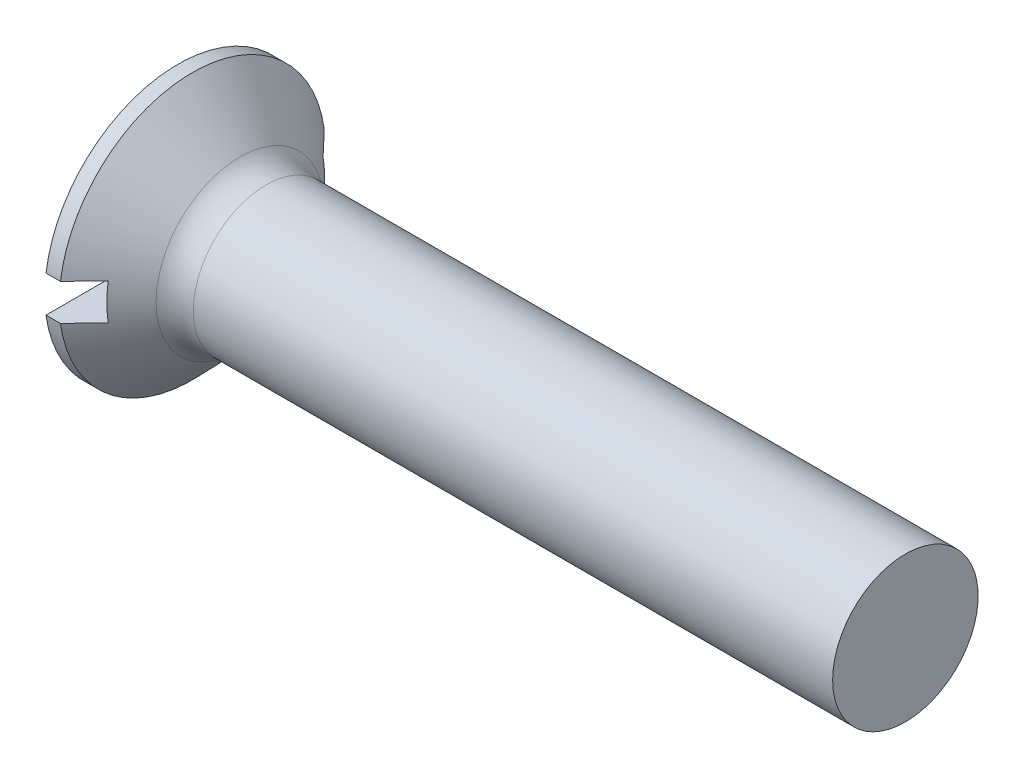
ISO-10303-21;
HEADER;
FILE_DESCRIPTION(('STEP AP214'),'2;1');
FILE_NAME('part.step','',(''),(''),'','','');
FILE_SCHEMA(('AUTOMOTIVE_DESIGN { 1 0 10303 214 1 1 1 1 }'));
ENDSEC;
DATA;
#1=APPLICATION_CONTEXT('core data for automotive mechanical design processes');
#2=APPLICATION_PROTOCOL_DEFINITION('international standard','automotive_design',2000,#1);
#3=PRODUCT_CONTEXT('',#1,'mechanical');
#4=PRODUCT('Part','Part','',(#3));
#5=PRODUCT_RELATED_PRODUCT_CATEGORY('part','',(#4));
#6=PRODUCT_DEFINITION_FORMATION('','',#4);
#7=PRODUCT_DEFINITION_CONTEXT('part definition',#1,'design');
#8=PRODUCT_DEFINITION('design','',#6,#7);
#9=PRODUCT_DEFINITION_SHAPE('','',#8);
#10=(LENGTH_UNIT() NAMED_UNIT(*) SI_UNIT(.MILLI.,.METRE.));
#11=(NAMED_UNIT(*) PLANE_ANGLE_UNIT() SI_UNIT($,.RADIAN.));
#12=(NAMED_UNIT(*) SI_UNIT($,.STERADIAN.) SOLID_ANGLE_UNIT());
#13=UNCERTAINTY_MEASURE_WITH_UNIT(LENGTH_MEASURE(1.E-05),#10,'distance_accuracy_value','');
#14=(GEOMETRIC_REPRESENTATION_CONTEXT(3) GLOBAL_UNCERTAINTY_ASSIGNED_CONTEXT((#13)) GLOBAL_UNIT_ASSIGNED_CONTEXT((#10,
#11,#12)) REPRESENTATION_CONTEXT('',''));
#15=CARTESIAN_POINT('',(0.,0.,0.));
#16=DIRECTION('',(0.,0.,1.));
#17=DIRECTION('',(1.,0.,0.));
#18=AXIS2_PLACEMENT_3D('',#15,#16,#17);
#19=CARTESIAN_POINT('',(0.,0.,0.));
#20=DIRECTION('',(-1.,0.,0.));
#21=DIRECTION('',(0.,0.,1.));
#22=AXIS2_PLACEMENT_3D('',#19,#20,#21);
#23=PLANE('',#22);
#24=DIRECTION('',(0.,0.,-1.));
#25=VECTOR('',#24,1.);
#26=CARTESIAN_POINT('',(0.,1.25,9.15));
#27=LINE('',#26,#25);
#28=CARTESIAN_POINT('',(0.,1.25,9.06421535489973));
#29=VERTEX_POINT('',#28);
#30=CARTESIAN_POINT('',(0.,1.25,-9.06421535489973));
#31=VERTEX_POINT('',#30);
#32=EDGE_CURVE('E171',#29,#31,#27,.T.);
#33=ORIENTED_EDGE('',*,*,#32,.F.);
#34=CARTESIAN_POINT('',(0.,0.,0.));
#35=DIRECTION('',(-1.,0.,0.));
#36=DIRECTION('',(0.,0.,1.));
#37=AXIS2_PLACEMENT_3D('',#34,#35,#36);
#38=CIRCLE('',#37,9.15);
#39=EDGE_CURVE('E115',#29,#31,#38,.T.);
#40=ORIENTED_EDGE('',*,*,#39,.T.);
#41=EDGE_LOOP('',(#33,#40));
#42=FACE_BOUND('',#41,.T.);
#43=ADVANCED_FACE('F34',(#42),#23,.T.);
#44=CARTESIAN_POINT('',(-6.34999999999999,0.,0.));
#45=DIRECTION('',(-1.,0.,0.));
#46=DIRECTION('',(0.,0.,1.));
#47=AXIS2_PLACEMENT_3D('',#44,#45,#46);
#48=CYLINDRICAL_SURFACE('',#47,9.15);
#49=DIRECTION('',(-1.,0.,0.));
#50=VECTOR('',#49,1.);
#51=CARTESIAN_POINT('',(-6.34999999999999,1.25,-9.06421535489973));
#52=LINE('',#51,#50);
#53=CARTESIAN_POINT('',(0.992391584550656,1.25,-9.06421535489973));
#54=VERTEX_POINT('',#53);
#55=EDGE_CURVE('E62',#31,#54,#52,.F.);
#56=ORIENTED_EDGE('',*,*,#55,.F.);
#57=ORIENTED_EDGE('',*,*,#39,.F.);
#58=DIRECTION('',(-1.,0.,0.));
#59=VECTOR('',#58,1.);
#60=CARTESIAN_POINT('',(-6.34999999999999,1.25,9.06421535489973));
#61=LINE('',#60,#59);
#62=CARTESIAN_POINT('',(0.992391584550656,1.25,9.06421535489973));
#63=VERTEX_POINT('',#62);
#64=EDGE_CURVE('E177',#63,#29,#61,.T.);
#65=ORIENTED_EDGE('',*,*,#64,.F.);
#66=CARTESIAN_POINT('',(0.992391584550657,0.,0.));
#67=DIRECTION('',(-1.,0.,0.));
#68=DIRECTION('',(0.,0.,1.));
#69=AXIS2_PLACEMENT_3D('',#66,#67,#68);
#70=CIRCLE('',#69,9.15);
#71=EDGE_CURVE('E109',#63,#54,#70,.T.);
#72=ORIENTED_EDGE('',*,*,#71,.T.);
#73=EDGE_LOOP('',(#56,#57,#65,#72));
#74=FACE_BOUND('',#73,.T.);
#75=ADVANCED_FACE('F155',(#74),#48,.T.);
#76=DIRECTION('',(0.,0.,1.));
#77=VECTOR('',#76,1.);
#78=CARTESIAN_POINT('',(0.,-1.25,-9.15));
#79=LINE('',#78,#77);
#80=CARTESIAN_POINT('',(0.,-1.25,-9.06421535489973));
#81=VERTEX_POINT('',#80);
#82=CARTESIAN_POINT('',(0.,-1.25,9.06421535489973));
#83=VERTEX_POINT('',#82);
#84=EDGE_CURVE('E103',#81,#83,#79,.T.);
#85=ORIENTED_EDGE('',*,*,#84,.F.);
#86=EDGE_CURVE('E111',#81,#83,#38,.T.);
#87=ORIENTED_EDGE('',*,*,#86,.T.);
#88=EDGE_LOOP('',(#85,#87));
#89=FACE_BOUND('',#88,.T.);
#90=ADVANCED_FACE('F157',(#89),#23,.T.);
#91=DIRECTION('',(-1.,0.,0.));
#92=VECTOR('',#91,1.);
#93=CARTESIAN_POINT('',(-6.34999999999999,-1.25,9.06421535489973));
#94=LINE('',#93,#92);
#95=CARTESIAN_POINT('',(0.992391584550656,-1.25,9.06421535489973));
#96=VERTEX_POINT('',#95);
#97=EDGE_CURVE('E176',#83,#96,#94,.F.);
#98=ORIENTED_EDGE('',*,*,#97,.F.);
#99=ORIENTED_EDGE('',*,*,#86,.F.);
#100=DIRECTION('',(-1.,0.,0.));
#101=VECTOR('',#100,1.);
#102=CARTESIAN_POINT('',(-6.34999999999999,-1.25,-9.06421535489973));
#103=LINE('',#102,#101);
#104=CARTESIAN_POINT('',(0.992391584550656,-1.25,-9.06421535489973));
#105=VERTEX_POINT('',#104);
#106=EDGE_CURVE('E174',#105,#81,#103,.T.);
#107=ORIENTED_EDGE('',*,*,#106,.F.);
#108=EDGE_CURVE('E112',#105,#96,#70,.T.);
#109=ORIENTED_EDGE('',*,*,#108,.T.);
#110=EDGE_LOOP('',(#98,#99,#107,#109));
#111=FACE_BOUND('',#110,.T.);
#112=ADVANCED_FACE('F152',(#111),#48,.T.);
#113=CARTESIAN_POINT('',(0.992391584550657,0.,0.));
#114=DIRECTION('',(-1.,0.,0.));
#115=DIRECTION('',(0.,0.,1.));
#116=AXIS2_PLACEMENT_3D('',#113,#114,#115);
#117=CONICAL_SURFACE('',#116,9.15,0.802851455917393);
#118=CARTESIAN_POINT('',(-9.68926312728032,1.25,-20.1724858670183));
#119=CARTESIAN_POINT('',(-9.01424055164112,1.25,-19.4721279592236));
#120=CARTESIAN_POINT('',(-8.33927740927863,1.25,-18.7717127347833));
#121=CARTESIAN_POINT('',(-6.98953385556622,1.25,-17.3706787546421));
#122=CARTESIAN_POINT('',(-6.31475344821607,1.25,-16.6700599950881));
#123=CARTESIAN_POINT('',(-4.96516589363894,1.25,-15.2682460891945));
#124=CARTESIAN_POINT('',(-4.29035886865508,1.25,-14.5670508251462));
#125=CARTESIAN_POINT('',(-2.94117950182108,1.25,-13.1642690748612));
#126=CARTESIAN_POINT('',(-2.26680715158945,1.25,-12.4626825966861));
#127=CARTESIAN_POINT('',(-0.909509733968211,1.25,-11.0492554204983));
#128=CARTESIAN_POINT('',(-0.226593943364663,1.25,-10.3374058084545));
#129=CARTESIAN_POINT('',(0.796845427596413,1.25,-9.26869429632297));
#130=CARTESIAN_POINT('',(1.13784669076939,1.25,-8.91228991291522));
#131=CARTESIAN_POINT('',(1.81938768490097,1.25,-8.19904421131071));
#132=CARTESIAN_POINT('',(2.15992741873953,1.25,-7.8422028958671));
#133=CARTESIAN_POINT('',(2.84022999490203,1.25,-7.12797275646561));
#134=CARTESIAN_POINT('',(3.17999302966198,1.25,-6.77058411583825));
#135=CARTESIAN_POINT('',(3.85846834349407,1.25,-6.05479291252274));
#136=CARTESIAN_POINT('',(4.19718059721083,1.25,-5.69639032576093));
#137=CARTESIAN_POINT('',(4.70385175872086,1.25,-5.15750839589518));
#138=CARTESIAN_POINT('',(4.87250030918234,1.25,-4.97767771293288));
#139=CARTESIAN_POINT('',(5.20915994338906,1.25,-4.61742089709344));
#140=CARTESIAN_POINT('',(5.37717102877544,1.25,-4.4369947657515));
#141=CARTESIAN_POINT('',(5.71228703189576,1.25,-4.07531534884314));
#142=CARTESIAN_POINT('',(5.8793919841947,1.25,-3.89406209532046));
#143=CARTESIAN_POINT('',(6.21227568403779,1.25,-3.53034270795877));
#144=CARTESIAN_POINT('',(6.3780544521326,1.25,-3.34787659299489));
#145=CARTESIAN_POINT('',(6.58515551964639,1.25,-3.1172860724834));
#146=CARTESIAN_POINT('',(6.62745985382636,1.25,-3.07004359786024));
#147=CARTESIAN_POINT('',(6.71190694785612,1.25,-2.97541424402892));
#148=CARTESIAN_POINT('',(6.75404970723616,1.25,-2.92802736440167));
#149=CARTESIAN_POINT('',(6.88020481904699,1.25,-2.78562134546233));
#150=CARTESIAN_POINT('',(6.96394260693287,1.25,-2.69035838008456));
#151=CARTESIAN_POINT('',(7.1304020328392,1.25,-2.49902470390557));
#152=CARTESIAN_POINT('',(7.21312412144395,1.25,-2.4029543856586));
#153=CARTESIAN_POINT('',(7.37722405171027,1.25,-2.20967422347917));
#154=CARTESIAN_POINT('',(7.45860194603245,1.25,-2.11246442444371));
#155=CARTESIAN_POINT('',(7.59838190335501,1.25,-1.94211253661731));
#156=CARTESIAN_POINT('',(7.65722241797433,1.25,-1.8693308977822));
#157=CARTESIAN_POINT('',(7.77348883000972,1.25,-1.72264602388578));
#158=CARTESIAN_POINT('',(7.83091478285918,1.25,-1.64874283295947));
#159=CARTESIAN_POINT('',(7.94389223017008,1.25,-1.49935163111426));
#160=CARTESIAN_POINT('',(7.9994410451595,1.25,-1.42386158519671));
#161=CARTESIAN_POINT('',(8.10773741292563,1.25,-1.27089958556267));
#162=CARTESIAN_POINT('',(8.16048561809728,1.25,-1.19342809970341));
#163=CARTESIAN_POINT('',(8.2441217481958,1.25,-1.06328283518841));
#164=CARTESIAN_POINT('',(8.27621566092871,1.25,-1.0113877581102));
#165=CARTESIAN_POINT('',(8.33803425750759,1.25,-0.90621123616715));
#166=CARTESIAN_POINT('',(8.36775953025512,1.25,-0.852930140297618));
#167=CARTESIAN_POINT('',(8.42399674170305,1.25,-0.744779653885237));
#168=CARTESIAN_POINT('',(8.4505137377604,1.25,-0.689912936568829));
#169=CARTESIAN_POINT('',(8.49926370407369,1.25,-0.578338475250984));
#170=CARTESIAN_POINT('',(8.52149935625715,1.25,-0.521631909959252));
#171=CARTESIAN_POINT('',(8.56630944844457,1.25,-0.388189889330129));
#172=CARTESIAN_POINT('',(8.58683338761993,1.25,-0.310716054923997));
#173=CARTESIAN_POINT('',(8.60761821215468,1.25,-0.192881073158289));
#174=CARTESIAN_POINT('',(8.61287928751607,1.25,-0.153381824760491));
#175=CARTESIAN_POINT('',(8.61981602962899,1.25,-0.0740612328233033));
#176=CARTESIAN_POINT('',(8.62149192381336,1.25,-0.0342399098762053));
#177=CARTESIAN_POINT('',(8.62114932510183,1.25,0.0455181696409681));
#178=CARTESIAN_POINT('',(8.61911849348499,1.25,0.0854548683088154));
#179=CARTESIAN_POINT('',(8.61146403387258,1.25,0.164983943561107));
#180=CARTESIAN_POINT('',(8.60583973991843,1.25,0.204576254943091));
#181=CARTESIAN_POINT('',(8.59129476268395,1.25,0.283243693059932));
#182=CARTESIAN_POINT('',(8.58236590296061,1.25,0.322317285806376));
#183=CARTESIAN_POINT('',(8.56163589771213,1.25,0.39968443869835));
#184=CARTESIAN_POINT('',(8.54983459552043,1.25,0.437977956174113));
#185=CARTESIAN_POINT('',(8.50721080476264,1.25,0.562063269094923));
#186=CARTESIAN_POINT('',(8.47133142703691,1.25,0.64611632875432));
#187=CARTESIAN_POINT('',(8.3915225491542,1.25,0.810325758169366));
#188=CARTESIAN_POINT('',(8.34757602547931,1.25,0.890473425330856));
#189=CARTESIAN_POINT('',(8.25413254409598,1.25,1.04839009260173));
#190=CARTESIAN_POINT('',(8.20458979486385,1.25,1.12613167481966));
#191=CARTESIAN_POINT('',(8.12771236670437,1.25,1.2409397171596));
#192=CARTESIAN_POINT('',(8.10167239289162,1.25,1.27889064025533));
#193=CARTESIAN_POINT('',(8.04887104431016,1.25,1.35428659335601));
#194=CARTESIAN_POINT('',(8.02210969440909,1.25,1.39173164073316));
#195=CARTESIAN_POINT('',(7.93508459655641,1.25,1.51146882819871));
#196=CARTESIAN_POINT('',(7.87365988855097,1.25,1.59291626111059));
#197=CARTESIAN_POINT('',(7.74881393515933,1.25,1.75427079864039));
#198=CARTESIAN_POINT('',(7.685392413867,1.25,1.8341776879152));
#199=CARTESIAN_POINT('',(7.55709587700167,1.25,1.99286763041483));
#200=CARTESIAN_POINT('',(7.49222027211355,1.25,2.07165020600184));
#201=CARTESIAN_POINT('',(7.36141091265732,1.25,2.22833328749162));
#202=CARTESIAN_POINT('',(7.29547712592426,1.25,2.3062337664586));
#203=CARTESIAN_POINT('',(7.09628206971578,1.25,2.53915990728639));
#204=CARTESIAN_POINT('',(6.96182852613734,1.25,2.69316475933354));
#205=CARTESIAN_POINT('',(6.69102699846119,1.25,2.9994210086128));
#206=CARTESIAN_POINT('',(6.55467949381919,1.25,3.15167283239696));
#207=CARTESIAN_POINT('',(6.28142781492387,1.25,3.45421345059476));
#208=CARTESIAN_POINT('',(6.14453041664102,1.25,3.6045083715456));
#209=CARTESIAN_POINT('',(5.86984700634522,1.25,3.90430012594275));
#210=CARTESIAN_POINT('',(5.73206093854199,1.25,4.05379690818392));
#211=CARTESIAN_POINT('',(5.45598064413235,1.25,4.35206183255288));
#212=CARTESIAN_POINT('',(5.31768700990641,1.25,4.50083052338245));
#213=CARTESIAN_POINT('',(5.04062692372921,1.25,4.79792076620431));
#214=CARTESIAN_POINT('',(4.90186048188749,1.25,4.94624232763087));
#215=CARTESIAN_POINT('',(4.4660705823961,1.25,5.41091009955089));
#216=CARTESIAN_POINT('',(4.16840754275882,1.25,5.72665630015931));
#217=CARTESIAN_POINT('',(3.57209808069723,1.25,6.35721911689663));
#218=CARTESIAN_POINT('',(3.27345165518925,1.25,6.67203573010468));
#219=CARTESIAN_POINT('',(2.67550675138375,1.25,7.30105820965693));
#220=CARTESIAN_POINT('',(2.3762082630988,1.25,7.61526406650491));
#221=CARTESIAN_POINT('',(1.77716463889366,1.25,8.24324979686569));
#222=CARTESIAN_POINT('',(1.47741950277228,1.25,8.55702967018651));
#223=CARTESIAN_POINT('',(0.57744252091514,1.25,9.49819852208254));
#224=CARTESIAN_POINT('',(-0.0232625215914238,1.25,10.1251349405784));
#225=CARTESIAN_POINT('',(-1.22537126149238,1.25,11.3783286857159));
#226=CARTESIAN_POINT('',(-1.82677495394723,1.25,12.004586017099));
#227=CARTESIAN_POINT('',(-3.03304692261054,1.25,13.2598195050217));
#228=CARTESIAN_POINT('',(-3.63791742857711,1.25,13.8887935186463));
#229=CARTESIAN_POINT('',(-4.84795516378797,1.25,15.1464588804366));
#230=CARTESIAN_POINT('',(-5.45312239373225,1.25,15.7751502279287));
#231=CARTESIAN_POINT('',(-6.66336846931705,1.25,17.0320308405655));
#232=CARTESIAN_POINT('',(-7.26844721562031,1.25,17.6602202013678));
#233=CARTESIAN_POINT('',(-8.47875515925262,1.25,18.916450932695));
#234=CARTESIAN_POINT('',(-9.08398435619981,1.25,19.5444923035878));
#235=CARTESIAN_POINT('',(-9.68926312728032,1.25,20.1724858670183));
#236=B_SPLINE_CURVE_WITH_KNOTS('',3,(#118,#119,#120,#121,#122,#123,#124,#125,#126,#127,#128,
#129,#130,#131,#132,#133,#134,#135,#136,#137,#138,#139,#140,#141,#142,#143,#144,#145,#146,#147,
#148,#149,#150,#151,#152,#153,#154,#155,#156,#157,#158,#159,#160,#161,#162,#163,#164,#165,#166,
#167,#168,#169,#170,#171,#172,#173,#174,#175,#176,#177,#178,#179,#180,#181,#182,#183,#184,#185,
#186,#187,#188,#189,#190,#191,#192,#193,#194,#195,#196,#197,#198,#199,#200,#201,#202,#203,#204,
#205,#206,#207,#208,#209,#210,#211,#212,#213,#214,#215,#216,#217,#218,#219,#220,#221,#222,#223,
#224,#225,#226,#227,#228,#229,#230,#231,#232,#233,#234,#235),.UNSPECIFIED.,.F.,.F.,(4,2,2,2,2,2,
2,2,2,2,2,2,2,2,2,2,2,2,2,2,2,2,2,2,2,2,2,2,2,2,2,2,2,2,2,2,2,2,2,2,2,2,2,2,2,2,2,2,2,2,2,2,2,2,
2,2,2,2,4),(0.,2.91811758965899,5.8362945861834,8.75577280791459,11.675192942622,
14.634572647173,16.1143539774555,17.5941260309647,19.073479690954,20.5528687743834,
21.2924843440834,22.0320980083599,22.7716832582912,23.5112570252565,23.7015027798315,
23.8917490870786,24.2722479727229,24.6525714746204,25.0328800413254,25.3136423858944,
25.5943937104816,25.8755301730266,26.1566008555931,26.3396067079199,26.522566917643,
26.705234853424,26.8877879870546,27.1271855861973,27.2465897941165,27.3659864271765,
27.4857812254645,27.6055982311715,27.7257137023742,27.8458357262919,28.1192285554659,
28.3932050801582,28.669612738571,28.8076846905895,28.9457518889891,29.2517399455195,
29.5577704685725,29.8639273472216,30.1700935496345,30.7833784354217,31.396510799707,
32.0063949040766,32.6163176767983,33.2256727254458,33.8350148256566,35.1368133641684,
36.4386159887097,37.7404386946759,39.0422619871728,41.6470760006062,44.2518717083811,
46.8697504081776,49.4876353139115,52.1042513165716,54.7208607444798),.UNSPECIFIED.);
#237=CARTESIAN_POINT('',(2.6,1.25,7.38016315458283));
#238=VERTEX_POINT('',#237);
#239=EDGE_CURVE('E11',#238,#63,#236,.T.);
#240=ORIENTED_EDGE('',*,*,#239,.F.);
#241=CARTESIAN_POINT('',(2.6,0.,0.));
#242=DIRECTION('',(1.,0.,0.));
#243=DIRECTION('',(0.,0.,-1.));
#244=AXIS2_PLACEMENT_3D('',#241,#242,#243);
#245=CIRCLE('',#244,7.48527275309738);
#246=CARTESIAN_POINT('',(2.6,-1.25,7.38016315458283));
#247=VERTEX_POINT('',#246);
#248=EDGE_CURVE('E91',#247,#238,#245,.F.);
#249=ORIENTED_EDGE('',*,*,#248,.F.);
#250=CARTESIAN_POINT('',(-9.68926312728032,-1.25,20.1724858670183));
#251=CARTESIAN_POINT('',(-9.01424055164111,-1.25,19.4721279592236));
#252=CARTESIAN_POINT('',(-8.33927740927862,-1.25,18.7717127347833));
#253=CARTESIAN_POINT('',(-6.9895338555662,-1.25,17.3706787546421));
#254=CARTESIAN_POINT('',(-6.31475344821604,-1.25,16.670059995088));
#255=CARTESIAN_POINT('',(-4.9651658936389,-1.25,15.2682460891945));
#256=CARTESIAN_POINT('',(-4.29035886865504,-1.25,14.5670508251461));
#257=CARTESIAN_POINT('',(-2.94117950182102,-1.25,13.1642690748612));
#258=CARTESIAN_POINT('',(-2.26680715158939,-1.25,12.4626825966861));
#259=CARTESIAN_POINT('',(-0.909509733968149,-1.25,11.0492554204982));
#260=CARTESIAN_POINT('',(-0.226593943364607,-1.25,10.3374058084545));
#261=CARTESIAN_POINT('',(0.79684542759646,-1.25,9.26869429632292));
#262=CARTESIAN_POINT('',(1.13784669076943,-1.25,8.91228991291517));
#263=CARTESIAN_POINT('',(1.81938768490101,-1.25,8.19904421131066));
#264=CARTESIAN_POINT('',(2.15992741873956,-1.25,7.84220289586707));
#265=CARTESIAN_POINT('',(2.84022999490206,-1.25,7.12797275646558));
#266=CARTESIAN_POINT('',(3.17999302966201,-1.25,6.77058411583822));
#267=CARTESIAN_POINT('',(3.85846834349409,-1.25,6.05479291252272));
#268=CARTESIAN_POINT('',(4.19718059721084,-1.25,5.69639032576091));
#269=CARTESIAN_POINT('',(4.70385175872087,-1.25,5.15750839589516));
#270=CARTESIAN_POINT('',(4.87250030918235,-1.25,4.97767771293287));
#271=CARTESIAN_POINT('',(5.20915994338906,-1.25,4.61742089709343));
#272=CARTESIAN_POINT('',(5.37717102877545,-1.25,4.4369947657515));
#273=CARTESIAN_POINT('',(5.71228703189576,-1.25,4.07531534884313));
#274=CARTESIAN_POINT('',(5.8793919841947,-1.25,3.89406209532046));
#275=CARTESIAN_POINT('',(6.21227568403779,-1.25,3.53034270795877));
#276=CARTESIAN_POINT('',(6.3780544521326,-1.25,3.34787659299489));
#277=CARTESIAN_POINT('',(6.58515551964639,-1.25,3.1172860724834));
#278=CARTESIAN_POINT('',(6.62745985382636,-1.25,3.07004359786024));
#279=CARTESIAN_POINT('',(6.71190694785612,-1.25,2.97541424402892));
#280=CARTESIAN_POINT('',(6.75404970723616,-1.25,2.92802736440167));
#281=CARTESIAN_POINT('',(6.88020481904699,-1.25,2.78562134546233));
#282=CARTESIAN_POINT('',(6.96394260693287,-1.25,2.69035838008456));
#283=CARTESIAN_POINT('',(7.1304020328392,-1.25,2.49902470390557));
#284=CARTESIAN_POINT('',(7.21312412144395,-1.25,2.4029543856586));
#285=CARTESIAN_POINT('',(7.37722405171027,-1.25,2.20967422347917));
#286=CARTESIAN_POINT('',(7.45860194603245,-1.25,2.11246442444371));
#287=CARTESIAN_POINT('',(7.59838190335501,-1.25,1.94211253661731));
#288=CARTESIAN_POINT('',(7.65722241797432,-1.25,1.8693308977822));
#289=CARTESIAN_POINT('',(7.77348883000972,-1.25,1.72264602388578));
#290=CARTESIAN_POINT('',(7.83091478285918,-1.25,1.64874283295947));
#291=CARTESIAN_POINT('',(7.94389223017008,-1.25,1.49935163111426));
#292=CARTESIAN_POINT('',(7.9994410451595,-1.25,1.42386158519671));
#293=CARTESIAN_POINT('',(8.10773741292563,-1.25,1.27089958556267));
#294=CARTESIAN_POINT('',(8.16048561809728,-1.25,1.1934280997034));
#295=CARTESIAN_POINT('',(8.24412174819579,-1.25,1.06328283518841));
#296=CARTESIAN_POINT('',(8.27621566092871,-1.25,1.0113877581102));
#297=CARTESIAN_POINT('',(8.33803425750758,-1.25,0.906211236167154));
#298=CARTESIAN_POINT('',(8.36775953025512,-1.25,0.852930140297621));
#299=CARTESIAN_POINT('',(8.42399674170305,-1.25,0.744779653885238));
#300=CARTESIAN_POINT('',(8.4505137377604,-1.25,0.689912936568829));
#301=CARTESIAN_POINT('',(8.49926370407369,-1.25,0.578338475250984));
#302=CARTESIAN_POINT('',(8.52149935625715,-1.25,0.521631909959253));
#303=CARTESIAN_POINT('',(8.56630944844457,-1.25,0.388189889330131));
#304=CARTESIAN_POINT('',(8.58683338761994,-1.25,0.310716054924));
#305=CARTESIAN_POINT('',(8.60761821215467,-1.25,0.192881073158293));
#306=CARTESIAN_POINT('',(8.61287928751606,-1.25,0.153381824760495));
#307=CARTESIAN_POINT('',(8.61981602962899,-1.25,0.0740612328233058));
#308=CARTESIAN_POINT('',(8.62149192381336,-1.25,0.0342399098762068));
#309=CARTESIAN_POINT('',(8.62114932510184,-1.25,-0.0455181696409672));
#310=CARTESIAN_POINT('',(8.61911849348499,-1.25,-0.0854548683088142));
#311=CARTESIAN_POINT('',(8.61146403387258,-1.25,-0.164983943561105));
#312=CARTESIAN_POINT('',(8.60583973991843,-1.25,-0.204576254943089));
#313=CARTESIAN_POINT('',(8.59129476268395,-1.25,-0.283243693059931));
#314=CARTESIAN_POINT('',(8.58236590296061,-1.25,-0.322317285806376));
#315=CARTESIAN_POINT('',(8.56163589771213,-1.25,-0.39968443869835));
#316=CARTESIAN_POINT('',(8.54983459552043,-1.25,-0.437977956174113));
#317=CARTESIAN_POINT('',(8.50721080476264,-1.25,-0.562063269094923));
#318=CARTESIAN_POINT('',(8.47133142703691,-1.25,-0.646116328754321));
#319=CARTESIAN_POINT('',(8.3915225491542,-1.25,-0.810325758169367));
#320=CARTESIAN_POINT('',(8.3475760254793,-1.25,-0.890473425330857));
#321=CARTESIAN_POINT('',(8.25413254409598,-1.25,-1.04839009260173));
#322=CARTESIAN_POINT('',(8.20458979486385,-1.25,-1.12613167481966));
#323=CARTESIAN_POINT('',(8.12771236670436,-1.25,-1.2409397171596));
#324=CARTESIAN_POINT('',(8.10167239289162,-1.25,-1.27889064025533));
#325=CARTESIAN_POINT('',(8.04887104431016,-1.25,-1.35428659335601));
#326=CARTESIAN_POINT('',(8.02210969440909,-1.25,-1.39173164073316));
#327=CARTESIAN_POINT('',(7.93508459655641,-1.25,-1.51146882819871));
#328=CARTESIAN_POINT('',(7.87365988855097,-1.25,-1.59291626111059));
#329=CARTESIAN_POINT('',(7.74881393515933,-1.25,-1.75427079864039));
#330=CARTESIAN_POINT('',(7.685392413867,-1.25,-1.8341776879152));
#331=CARTESIAN_POINT('',(7.55709587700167,-1.25,-1.99286763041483));
#332=CARTESIAN_POINT('',(7.49222027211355,-1.25,-2.07165020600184));
#333=CARTESIAN_POINT('',(7.36141091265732,-1.25,-2.22833328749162));
#334=CARTESIAN_POINT('',(7.29547712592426,-1.25,-2.3062337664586));
#335=CARTESIAN_POINT('',(7.09628206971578,-1.25,-2.53915990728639));
#336=CARTESIAN_POINT('',(6.96182852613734,-1.25,-2.69316475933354));
#337=CARTESIAN_POINT('',(6.69102699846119,-1.25,-2.9994210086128));
#338=CARTESIAN_POINT('',(6.55467949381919,-1.25,-3.15167283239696));
#339=CARTESIAN_POINT('',(6.28142781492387,-1.25,-3.45421345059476));
#340=CARTESIAN_POINT('',(6.14453041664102,-1.25,-3.6045083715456));
#341=CARTESIAN_POINT('',(5.86984700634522,-1.25,-3.90430012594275));
#342=CARTESIAN_POINT('',(5.73206093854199,-1.25,-4.05379690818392));
#343=CARTESIAN_POINT('',(5.45598064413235,-1.25,-4.35206183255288));
#344=CARTESIAN_POINT('',(5.31768700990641,-1.25,-4.50083052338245));
#345=CARTESIAN_POINT('',(5.04062692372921,-1.25,-4.79792076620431));
#346=CARTESIAN_POINT('',(4.90186048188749,-1.25,-4.94624232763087));
#347=CARTESIAN_POINT('',(4.4660705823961,-1.25,-5.4109100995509));
#348=CARTESIAN_POINT('',(4.16840754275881,-1.25,-5.72665630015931));
#349=CARTESIAN_POINT('',(3.57209808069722,-1.25,-6.35721911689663));
#350=CARTESIAN_POINT('',(3.27345165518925,-1.25,-6.67203573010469));
#351=CARTESIAN_POINT('',(2.67550675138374,-1.25,-7.30105820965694));
#352=CARTESIAN_POINT('',(2.37620826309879,-1.25,-7.61526406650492));
#353=CARTESIAN_POINT('',(1.77716463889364,-1.25,-8.2432497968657));
#354=CARTESIAN_POINT('',(1.47741950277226,-1.25,-8.55702967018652));
#355=CARTESIAN_POINT('',(0.577442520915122,-1.25,-9.49819852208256));
#356=CARTESIAN_POINT('',(-0.0232625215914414,-1.25,-10.1251349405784));
#357=CARTESIAN_POINT('',(-1.2253712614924,-1.25,-11.3783286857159));
#358=CARTESIAN_POINT('',(-1.82677495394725,-1.25,-12.004586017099));
#359=CARTESIAN_POINT('',(-3.03304692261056,-1.25,-13.2598195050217));
#360=CARTESIAN_POINT('',(-3.63791742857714,-1.25,-13.8887935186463));
#361=CARTESIAN_POINT('',(-4.84795516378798,-1.25,-15.1464588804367));
#362=CARTESIAN_POINT('',(-5.45312239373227,-1.25,-15.7751502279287));
#363=CARTESIAN_POINT('',(-6.66336846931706,-1.25,-17.0320308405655));
#364=CARTESIAN_POINT('',(-7.26844721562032,-1.25,-17.6602202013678));
#365=CARTESIAN_POINT('',(-8.47875515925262,-1.25,-18.9164509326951));
#366=CARTESIAN_POINT('',(-9.08398435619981,-1.25,-19.5444923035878));
#367=CARTESIAN_POINT('',(-9.68926312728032,-1.25,-20.1724858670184));
#368=B_SPLINE_CURVE_WITH_KNOTS('',3,(#250,#251,#252,#253,#254,#255,#256,#257,#258,#259,#260,
#261,#262,#263,#264,#265,#266,#267,#268,#269,#270,#271,#272,#273,#274,#275,#276,#277,#278,#279,
#280,#281,#282,#283,#284,#285,#286,#287,#288,#289,#290,#291,#292,#293,#294,#295,#296,#297,#298,
#299,#300,#301,#302,#303,#304,#305,#306,#307,#308,#309,#310,#311,#312,#313,#314,#315,#316,#317,
#318,#319,#320,#321,#322,#323,#324,#325,#326,#327,#328,#329,#330,#331,#332,#333,#334,#335,#336,
#337,#338,#339,#340,#341,#342,#343,#344,#345,#346,#347,#348,#349,#350,#351,#352,#353,#354,#355,
#356,#357,#358,#359,#360,#361,#362,#363,#364,#365,#366,#367),.UNSPECIFIED.,.F.,.F.,(4,2,2,2,2,2,
2,2,2,2,2,2,2,2,2,2,2,2,2,2,2,2,2,2,2,2,2,2,2,2,2,2,2,2,2,2,2,2,2,2,2,2,2,2,2,2,2,2,2,2,2,2,2,2,
2,2,2,2,4),(0.,2.91811758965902,5.83629458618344,8.75577280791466,11.6751929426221,
14.634572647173,16.1143539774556,17.5941260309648,19.073479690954,20.5528687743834,
21.2924843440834,22.03209800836,22.7716832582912,23.5112570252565,23.7015027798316,
23.8917490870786,24.2722479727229,24.6525714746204,25.0328800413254,25.3136423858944,
25.5943937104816,25.8755301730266,26.1566008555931,26.3396067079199,26.5225669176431,
26.705234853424,26.8877879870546,27.1271855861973,27.2465897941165,27.3659864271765,
27.4857812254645,27.6055982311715,27.7257137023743,27.8458357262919,28.1192285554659,
28.3932050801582,28.669612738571,28.8076846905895,28.9457518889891,29.2517399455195,
29.5577704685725,29.8639273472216,30.1700935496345,30.7833784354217,31.396510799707,
32.0063949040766,32.6163176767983,33.2256727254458,33.8350148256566,35.1368133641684,
36.4386159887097,37.7404386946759,39.0422619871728,41.6470760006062,44.2518717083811,
46.8697504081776,49.4876353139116,52.1042513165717,54.7208607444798),.UNSPECIFIED.);
#369=EDGE_CURVE('E48',#96,#247,#368,.T.);
#370=ORIENTED_EDGE('',*,*,#369,.F.);
#371=ORIENTED_EDGE('',*,*,#108,.F.);
#372=CARTESIAN_POINT('',(2.6,-1.25,-7.38016315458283));
#373=VERTEX_POINT('',#372);
#374=EDGE_CURVE('E127',#373,#105,#368,.T.);
#375=ORIENTED_EDGE('',*,*,#374,.F.);
#376=CARTESIAN_POINT('',(2.6,1.25,-7.38016315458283));
#377=VERTEX_POINT('',#376);
#378=EDGE_CURVE('E99',#377,#373,#245,.F.);
#379=ORIENTED_EDGE('',*,*,#378,.F.);
#380=EDGE_CURVE('E38',#54,#377,#236,.T.);
#381=ORIENTED_EDGE('',*,*,#380,.F.);
#382=ORIENTED_EDGE('',*,*,#71,.F.);
#383=EDGE_LOOP('',(#240,#249,#370,#371,#375,#379,#381,#382));
#384=FACE_BOUND('',#383,.T.);
#385=CARTESIAN_POINT('',(4.26283753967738,0.,0.));
#386=DIRECTION('',(-1.,0.,0.));
#387=DIRECTION('',(0.,0.,1.));
#388=AXIS2_PLACEMENT_3D('',#385,#386,#387);
#389=CIRCLE('',#388,5.76335407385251);
#390=CARTESIAN_POINT('',(4.26283753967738,0.,5.76335407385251));
#391=VERTEX_POINT('',#390);
#392=EDGE_CURVE('E122',#391,#391,#389,.T.);
#393=ORIENTED_EDGE('',*,*,#392,.T.);
#394=EDGE_LOOP('',(#393));
#395=FACE_BOUND('',#394,.T.);
#396=ADVANCED_FACE('F106',(#384,#395),#117,.T.);
#397=CARTESIAN_POINT('',(-6.34999999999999,0.,0.));
#398=DIRECTION('',(-1.,0.,0.));
#399=DIRECTION('',(0.,0.,1.));
#400=AXIS2_PLACEMENT_3D('',#397,#398,#399);
#401=CYLINDRICAL_SURFACE('',#400,5.);
#402=CARTESIAN_POINT('',(6.06118704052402,0.,0.));
#403=DIRECTION('',(-1.,0.,0.));
#404=DIRECTION('',(0.,0.,1.));
#405=AXIS2_PLACEMENT_3D('',#402,#403,#404);
#406=CIRCLE('',#405,5.);
#407=CARTESIAN_POINT('',(6.06118704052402,0.,5.));
#408=VERTEX_POINT('',#407);
#409=EDGE_CURVE('E125',#408,#408,#406,.F.);
#410=ORIENTED_EDGE('',*,*,#409,.T.);
#411=EDGE_LOOP('',(#410));
#412=FACE_BOUND('',#411,.T.);
#413=CARTESIAN_POINT('',(50.,0.,0.));
#414=DIRECTION('',(-1.,0.,0.));
#415=DIRECTION('',(0.,0.,1.));
#416=AXIS2_PLACEMENT_3D('',#413,#414,#415);
#417=CIRCLE('',#416,5.);
#418=CARTESIAN_POINT('',(50.,0.,5.));
#419=VERTEX_POINT('',#418);
#420=EDGE_CURVE('E118',#419,#419,#417,.T.);
#421=ORIENTED_EDGE('',*,*,#420,.T.);
#422=EDGE_LOOP('',(#421));
#423=FACE_BOUND('',#422,.T.);
#424=ADVANCED_FACE('F145',(#412,#423),#401,.T.);
#425=CARTESIAN_POINT('',(50.,5.,0.));
#426=DIRECTION('',(1.,0.,0.));
#427=DIRECTION('',(0.,0.,-1.));
#428=AXIS2_PLACEMENT_3D('',#425,#426,#427);
#429=PLANE('',#428);
#430=ORIENTED_EDGE('',*,*,#420,.F.);
#431=EDGE_LOOP('',(#430));
#432=FACE_BOUND('',#431,.T.);
#433=ADVANCED_FACE('F143',(#432),#429,.T.);
#434=CARTESIAN_POINT('',(6.06118704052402,0.,0.));
#435=DIRECTION('',(-1.,0.,0.));
#436=DIRECTION('',(0.,0.,1.));
#437=AXIS2_PLACEMENT_3D('',#434,#435,#436);
#438=TOROIDAL_SURFACE('',#437,7.5,2.5);
#439=ORIENTED_EDGE('',*,*,#409,.F.);
#440=EDGE_LOOP('',(#439));
#441=FACE_BOUND('',#440,.T.);
#442=ORIENTED_EDGE('',*,*,#392,.F.);
#443=EDGE_LOOP('',(#442));
#444=FACE_BOUND('',#443,.T.);
#445=ADVANCED_FACE('F36',(#441,#444),#438,.F.);
#446=CARTESIAN_POINT('',(2.6,1.25,9.15));
#447=DIRECTION('',(0.,1.,0.));
#448=DIRECTION('',(0.,0.,1.));
#449=AXIS2_PLACEMENT_3D('',#446,#447,#448);
#450=PLANE('',#449);
#451=ORIENTED_EDGE('',*,*,#55,.T.);
#452=ORIENTED_EDGE('',*,*,#380,.T.);
#453=DIRECTION('',(0.,0.,-1.));
#454=VECTOR('',#453,1.);
#455=CARTESIAN_POINT('',(2.6,1.25,9.15));
#456=LINE('',#455,#454);
#457=EDGE_CURVE('E55',#238,#377,#456,.T.);
#458=ORIENTED_EDGE('',*,*,#457,.F.);
#459=ORIENTED_EDGE('',*,*,#239,.T.);
#460=ORIENTED_EDGE('',*,*,#64,.T.);
#461=ORIENTED_EDGE('',*,*,#32,.T.);
#462=EDGE_LOOP('',(#451,#452,#458,#459,#460,#461));
#463=FACE_BOUND('',#462,.T.);
#464=ADVANCED_FACE('F100',(#463),#450,.F.);
#465=CARTESIAN_POINT('',(2.6,-1.25,-9.15));
#466=DIRECTION('',(0.,-1.,0.));
#467=DIRECTION('',(0.,0.,-1.));
#468=AXIS2_PLACEMENT_3D('',#465,#466,#467);
#469=PLANE('',#468);
#470=ORIENTED_EDGE('',*,*,#97,.T.);
#471=ORIENTED_EDGE('',*,*,#369,.T.);
#472=DIRECTION('',(0.,0.,1.));
#473=VECTOR('',#472,1.);
#474=CARTESIAN_POINT('',(2.6,-1.25,-9.15));
#475=LINE('',#474,#473);
#476=EDGE_CURVE('E94',#373,#247,#475,.T.);
#477=ORIENTED_EDGE('',*,*,#476,.F.);
#478=ORIENTED_EDGE('',*,*,#374,.T.);
#479=ORIENTED_EDGE('',*,*,#106,.T.);
#480=ORIENTED_EDGE('',*,*,#84,.T.);
#481=EDGE_LOOP('',(#470,#471,#477,#478,#479,#480));
#482=FACE_BOUND('',#481,.T.);
#483=ADVANCED_FACE('F135',(#482),#469,.F.);
#484=CARTESIAN_POINT('',(2.6,-1.25,-9.15));
#485=DIRECTION('',(1.,0.,0.));
#486=DIRECTION('',(0.,0.,-1.));
#487=AXIS2_PLACEMENT_3D('',#484,#485,#486);
#488=PLANE('',#487);
#489=ORIENTED_EDGE('',*,*,#248,.T.);
#490=ORIENTED_EDGE('',*,*,#457,.T.);
#491=ORIENTED_EDGE('',*,*,#378,.T.);
#492=ORIENTED_EDGE('',*,*,#476,.T.);
#493=EDGE_LOOP('',(#489,#490,#491,#492));
#494=FACE_BOUND('',#493,.T.);
#495=ADVANCED_FACE('F92',(#494),#488,.F.);
#496=CLOSED_SHELL('',(#43,#75,#90,#112,#396,#424,#433,#445,#464,#483,#495));
#497=MANIFOLD_SOLID_BREP('B2',#496);
#498=ADVANCED_BREP_SHAPE_REPRESENTATION('',(#18,#497),#14);
#499=SHAPE_DEFINITION_REPRESENTATION(#9,#498);
ENDSEC;
END-ISO-10303-21;
